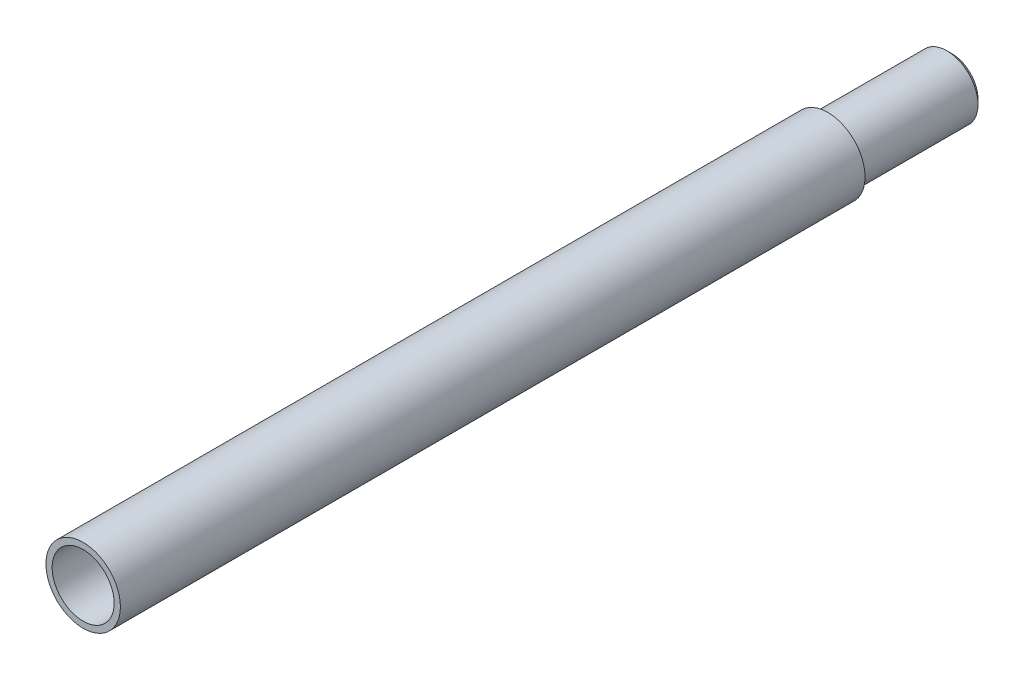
from build123d import *

# Parameters (mm, degrees)
ESQUISSE1_R          = 15
ESQUISSE1_R_2        = 12.5
BASE_EXTRUSION_DEPTH = 300
ESQUISSE2_R          = 12.5005
BOSS_EXTRU_3_DEPTH   = 50
CHANFREIN1_SIZE      = 2


with BuildPart() as part:
    # Esquisse1 → Base-Extrusion (new body)
    with BuildSketch(Plane.XY):
        Circle(ESQUISSE1_R)
        Circle(ESQUISSE1_R_2, mode=Mode.SUBTRACT)
    extrude(amount=BASE_EXTRUSION_DEPTH)

    # Esquisse2 → Boss.-Extru.3 (add)
    with BuildSketch(Plane(origin=(0, 0, 0), x_dir=(-1, 0, 0), z_dir=(0, 0, -1))):
        with Locations(Location((0, 0, 0), (0, 0, 180))):
            Circle(ESQUISSE2_R)
    extrude(amount=BOSS_EXTRU_3_DEPTH)

    # Chanfrein1
    chanfrein1_edges = [part.edges().sort_by_distance(p)[0] for p in [
        (-12.5005, 0, -50),
    ]]
    chamfer(chanfrein1_edges, length=CHANFREIN1_SIZE)


solid = part.part
